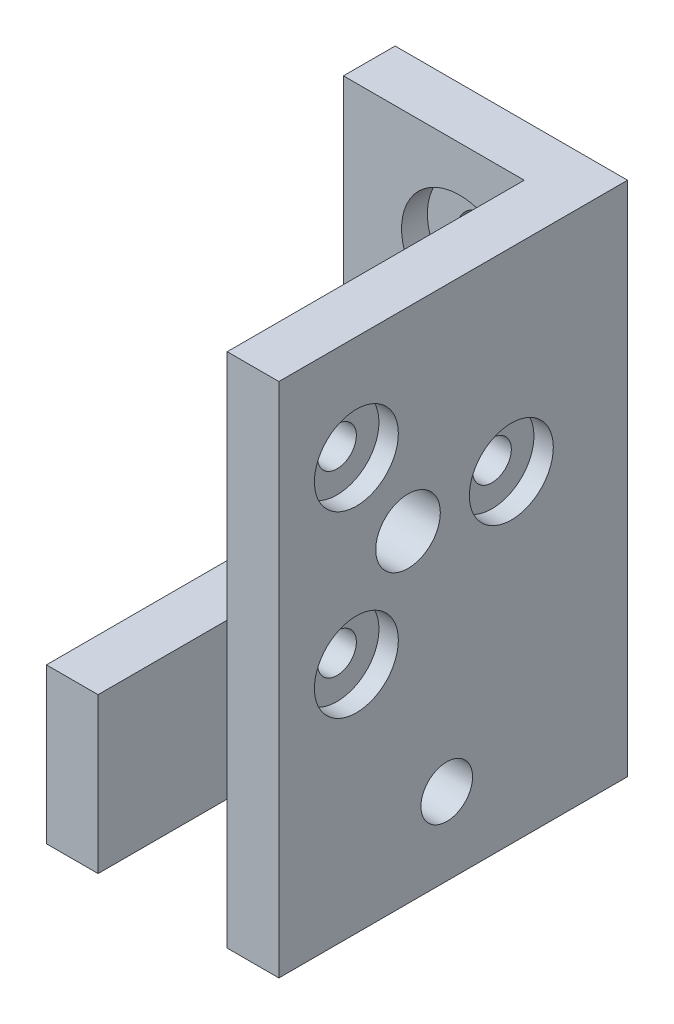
ISO-10303-21;
HEADER;
FILE_DESCRIPTION(('STEP AP214'),'2;1');
FILE_NAME('part.step','',(''),(''),'','','');
FILE_SCHEMA(('AUTOMOTIVE_DESIGN { 1 0 10303 214 1 1 1 1 }'));
ENDSEC;
DATA;
#1=APPLICATION_CONTEXT('core data for automotive mechanical design processes');
#2=APPLICATION_PROTOCOL_DEFINITION('international standard','automotive_design',2000,#1);
#3=PRODUCT_CONTEXT('',#1,'mechanical');
#4=PRODUCT('Part','Part','',(#3));
#5=PRODUCT_RELATED_PRODUCT_CATEGORY('part','',(#4));
#6=PRODUCT_DEFINITION_FORMATION('','',#4);
#7=PRODUCT_DEFINITION_CONTEXT('part definition',#1,'design');
#8=PRODUCT_DEFINITION('design','',#6,#7);
#9=PRODUCT_DEFINITION_SHAPE('','',#8);
#10=(LENGTH_UNIT() NAMED_UNIT(*) SI_UNIT(.MILLI.,.METRE.));
#11=(NAMED_UNIT(*) PLANE_ANGLE_UNIT() SI_UNIT($,.RADIAN.));
#12=(NAMED_UNIT(*) SI_UNIT($,.STERADIAN.) SOLID_ANGLE_UNIT());
#13=UNCERTAINTY_MEASURE_WITH_UNIT(LENGTH_MEASURE(1.E-05),#10,'distance_accuracy_value','');
#14=(GEOMETRIC_REPRESENTATION_CONTEXT(3) GLOBAL_UNCERTAINTY_ASSIGNED_CONTEXT((#13)) GLOBAL_UNIT_ASSIGNED_CONTEXT((#10,
#11,#12)) REPRESENTATION_CONTEXT('',''));
#15=CARTESIAN_POINT('',(0.,0.,0.));
#16=DIRECTION('',(0.,0.,1.));
#17=DIRECTION('',(1.,0.,0.));
#18=AXIS2_PLACEMENT_3D('',#15,#16,#17);
#19=CARTESIAN_POINT('',(9.,8.,-6.));
#20=DIRECTION('',(0.,0.,1.));
#21=DIRECTION('',(1.,0.,0.));
#22=AXIS2_PLACEMENT_3D('',#19,#20,#21);
#23=CYLINDRICAL_SURFACE('',#22,2.25);
#24=CARTESIAN_POINT('',(9.,8.,0.));
#25=DIRECTION('',(0.,0.,-1.));
#26=DIRECTION('',(-1.,0.,0.));
#27=AXIS2_PLACEMENT_3D('',#24,#25,#26);
#28=CIRCLE('',#27,2.25);
#29=CARTESIAN_POINT('',(6.75,8.,0.));
#30=VERTEX_POINT('',#29);
#31=EDGE_CURVE('E176',#30,#30,#28,.T.);
#32=ORIENTED_EDGE('',*,*,#31,.T.);
#33=EDGE_LOOP('',(#32));
#34=FACE_BOUND('',#33,.T.);
#35=CARTESIAN_POINT('',(9.,8.,2.));
#36=DIRECTION('',(0.,0.,1.));
#37=DIRECTION('',(1.,0.,0.));
#38=AXIS2_PLACEMENT_3D('',#35,#36,#37);
#39=CIRCLE('',#38,2.25);
#40=CARTESIAN_POINT('',(11.25,8.,2.));
#41=VERTEX_POINT('',#40);
#42=EDGE_CURVE('E37',#41,#41,#39,.F.);
#43=ORIENTED_EDGE('',*,*,#42,.F.);
#44=EDGE_LOOP('',(#43));
#45=FACE_BOUND('',#44,.T.);
#46=ADVANCED_FACE('F33',(#34,#45),#23,.F.);
#47=CARTESIAN_POINT('',(9.,32.,-6.));
#48=DIRECTION('',(0.,0.,1.));
#49=DIRECTION('',(1.,0.,0.));
#50=AXIS2_PLACEMENT_3D('',#47,#48,#49);
#51=CYLINDRICAL_SURFACE('',#50,2.25);
#52=CARTESIAN_POINT('',(9.,32.,0.));
#53=DIRECTION('',(0.,0.,-1.));
#54=DIRECTION('',(-1.,0.,0.));
#55=AXIS2_PLACEMENT_3D('',#52,#53,#54);
#56=CIRCLE('',#55,2.25);
#57=CARTESIAN_POINT('',(6.75,32.,0.));
#58=VERTEX_POINT('',#57);
#59=EDGE_CURVE('E172',#58,#58,#56,.T.);
#60=ORIENTED_EDGE('',*,*,#59,.T.);
#61=EDGE_LOOP('',(#60));
#62=FACE_BOUND('',#61,.T.);
#63=CARTESIAN_POINT('',(9.,32.,2.));
#64=DIRECTION('',(0.,0.,1.));
#65=DIRECTION('',(1.,0.,0.));
#66=AXIS2_PLACEMENT_3D('',#63,#64,#65);
#67=CIRCLE('',#66,2.25);
#68=CARTESIAN_POINT('',(11.25,32.,2.));
#69=VERTEX_POINT('',#68);
#70=EDGE_CURVE('E197',#69,#69,#67,.F.);
#71=ORIENTED_EDGE('',*,*,#70,.F.);
#72=EDGE_LOOP('',(#71));
#73=FACE_BOUND('',#72,.T.);
#74=ADVANCED_FACE('F308',(#62,#73),#51,.F.);
#75=CARTESIAN_POINT('',(24.,31.8923799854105,21.));
#76=DIRECTION('',(-1.,0.,0.));
#77=DIRECTION('',(0.,-1.,0.));
#78=AXIS2_PLACEMENT_3D('',#75,#76,#77);
#79=CYLINDRICAL_SURFACE('',#78,1.5);
#80=CARTESIAN_POINT('',(14.,31.8923799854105,21.));
#81=DIRECTION('',(-1.,0.,0.));
#82=DIRECTION('',(0.,-1.,0.));
#83=AXIS2_PLACEMENT_3D('',#80,#81,#82);
#84=CIRCLE('',#83,1.5);
#85=CARTESIAN_POINT('',(14.,30.3923799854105,21.));
#86=VERTEX_POINT('',#85);
#87=EDGE_CURVE('E231',#86,#86,#84,.T.);
#88=ORIENTED_EDGE('',*,*,#87,.T.);
#89=EDGE_LOOP('',(#88));
#90=FACE_BOUND('',#89,.T.);
#91=CARTESIAN_POINT('',(16.5,31.8923799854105,21.));
#92=DIRECTION('',(1.,0.,0.));
#93=DIRECTION('',(0.,0.,-1.));
#94=AXIS2_PLACEMENT_3D('',#91,#92,#93);
#95=CIRCLE('',#94,1.5);
#96=CARTESIAN_POINT('',(16.5,31.8923799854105,19.5));
#97=VERTEX_POINT('',#96);
#98=EDGE_CURVE('E193',#97,#97,#95,.F.);
#99=ORIENTED_EDGE('',*,*,#98,.F.);
#100=EDGE_LOOP('',(#99));
#101=FACE_BOUND('',#100,.T.);
#102=ADVANCED_FACE('F314',(#90,#101),#79,.F.);
#103=CARTESIAN_POINT('',(24.,18.0359735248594,21.));
#104=DIRECTION('',(-1.,0.,0.));
#105=DIRECTION('',(0.,-1.,0.));
#106=AXIS2_PLACEMENT_3D('',#103,#104,#105);
#107=CYLINDRICAL_SURFACE('',#106,1.5);
#108=CARTESIAN_POINT('',(14.,18.0359735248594,21.));
#109=DIRECTION('',(-1.,0.,0.));
#110=DIRECTION('',(0.,-1.,0.));
#111=AXIS2_PLACEMENT_3D('',#108,#109,#110);
#112=CIRCLE('',#111,1.5);
#113=CARTESIAN_POINT('',(14.,16.5359735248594,21.));
#114=VERTEX_POINT('',#113);
#115=EDGE_CURVE('E186',#114,#114,#112,.T.);
#116=ORIENTED_EDGE('',*,*,#115,.T.);
#117=EDGE_LOOP('',(#116));
#118=FACE_BOUND('',#117,.T.);
#119=CARTESIAN_POINT('',(16.5,18.0359735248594,21.));
#120=DIRECTION('',(1.,0.,0.));
#121=DIRECTION('',(0.,0.,-1.));
#122=AXIS2_PLACEMENT_3D('',#119,#120,#121);
#123=CIRCLE('',#122,1.5);
#124=CARTESIAN_POINT('',(16.5,18.0359735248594,19.5));
#125=VERTEX_POINT('',#124);
#126=EDGE_CURVE('E188',#125,#125,#123,.F.);
#127=ORIENTED_EDGE('',*,*,#126,.F.);
#128=EDGE_LOOP('',(#127));
#129=FACE_BOUND('',#128,.T.);
#130=ADVANCED_FACE('F339',(#118,#129),#107,.F.);
#131=CARTESIAN_POINT('',(24.,24.9641767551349,9.));
#132=DIRECTION('',(-1.,0.,0.));
#133=DIRECTION('',(0.,-1.,0.));
#134=AXIS2_PLACEMENT_3D('',#131,#132,#133);
#135=CYLINDRICAL_SURFACE('',#134,1.5);
#136=CARTESIAN_POINT('',(14.,24.9641767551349,9.));
#137=DIRECTION('',(-1.,0.,0.));
#138=DIRECTION('',(0.,-1.,0.));
#139=AXIS2_PLACEMENT_3D('',#136,#137,#138);
#140=CIRCLE('',#139,1.5);
#141=CARTESIAN_POINT('',(14.,23.4641767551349,9.));
#142=VERTEX_POINT('',#141);
#143=EDGE_CURVE('E228',#142,#142,#140,.T.);
#144=ORIENTED_EDGE('',*,*,#143,.T.);
#145=EDGE_LOOP('',(#144));
#146=FACE_BOUND('',#145,.T.);
#147=CARTESIAN_POINT('',(16.5,24.9641767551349,9.));
#148=DIRECTION('',(1.,0.,0.));
#149=DIRECTION('',(0.,0.,-1.));
#150=AXIS2_PLACEMENT_3D('',#147,#148,#149);
#151=CIRCLE('',#150,1.5);
#152=CARTESIAN_POINT('',(16.5,24.9641767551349,7.5));
#153=VERTEX_POINT('',#152);
#154=EDGE_CURVE('E183',#153,#153,#151,.F.);
#155=ORIENTED_EDGE('',*,*,#154,.F.);
#156=EDGE_LOOP('',(#155));
#157=FACE_BOUND('',#156,.T.);
#158=ADVANCED_FACE('F334',(#146,#157),#135,.F.);
#159=CARTESIAN_POINT('',(0.,40.,4.));
#160=DIRECTION('',(0.,0.,-1.));
#161=DIRECTION('',(-1.,0.,0.));
#162=AXIS2_PLACEMENT_3D('',#159,#160,#161);
#163=PLANE('',#162);
#164=CARTESIAN_POINT('',(9.,8.,4.));
#165=DIRECTION('',(0.,0.,1.));
#166=DIRECTION('',(1.,0.,0.));
#167=AXIS2_PLACEMENT_3D('',#164,#165,#166);
#168=CIRCLE('',#167,4.5);
#169=CARTESIAN_POINT('',(13.5,8.,4.));
#170=VERTEX_POINT('',#169);
#171=EDGE_CURVE('E213',#170,#170,#168,.T.);
#172=ORIENTED_EDGE('',*,*,#171,.F.);
#173=EDGE_LOOP('',(#172));
#174=FACE_BOUND('',#173,.T.);
#175=CARTESIAN_POINT('',(9.,32.,4.));
#176=DIRECTION('',(0.,0.,1.));
#177=DIRECTION('',(1.,0.,0.));
#178=AXIS2_PLACEMENT_3D('',#175,#176,#177);
#179=CIRCLE('',#178,4.5);
#180=CARTESIAN_POINT('',(13.5,32.,4.));
#181=VERTEX_POINT('',#180);
#182=EDGE_CURVE('E206',#181,#181,#179,.T.);
#183=ORIENTED_EDGE('',*,*,#182,.F.);
#184=EDGE_LOOP('',(#183));
#185=FACE_BOUND('',#184,.T.);
#186=DIRECTION('',(0.,-1.,0.));
#187=VECTOR('',#186,1.);
#188=CARTESIAN_POINT('',(14.,40.,4.));
#189=LINE('',#188,#187);
#190=CARTESIAN_POINT('',(14.,40.,4.));
#191=VERTEX_POINT('',#190);
#192=CARTESIAN_POINT('',(14.,0.,4.));
#193=VERTEX_POINT('',#192);
#194=EDGE_CURVE('E130',#191,#193,#189,.T.);
#195=ORIENTED_EDGE('',*,*,#194,.F.);
#196=DIRECTION('',(-1.,0.,0.));
#197=VECTOR('',#196,1.);
#198=CARTESIAN_POINT('',(0.,40.,4.));
#199=LINE('',#198,#197);
#200=CARTESIAN_POINT('',(0.,40.,4.));
#201=VERTEX_POINT('',#200);
#202=EDGE_CURVE('E262',#191,#201,#199,.T.);
#203=ORIENTED_EDGE('',*,*,#202,.T.);
#204=DIRECTION('',(0.,-1.,0.));
#205=VECTOR('',#204,1.);
#206=CARTESIAN_POINT('',(0.,0.,4.));
#207=LINE('',#206,#205);
#208=CARTESIAN_POINT('',(0.,12.,4.));
#209=VERTEX_POINT('',#208);
#210=EDGE_CURVE('E268',#201,#209,#207,.T.);
#211=ORIENTED_EDGE('',*,*,#210,.T.);
#212=DIRECTION('',(-1.,0.,0.));
#213=VECTOR('',#212,1.);
#214=CARTESIAN_POINT('',(0.,12.,4.));
#215=LINE('',#214,#213);
#216=CARTESIAN_POINT('',(4.,12.,4.));
#217=VERTEX_POINT('',#216);
#218=EDGE_CURVE('E147',#217,#209,#215,.T.);
#219=ORIENTED_EDGE('',*,*,#218,.F.);
#220=DIRECTION('',(0.,1.,0.));
#221=VECTOR('',#220,1.);
#222=CARTESIAN_POINT('',(4.,0.,4.));
#223=LINE('',#222,#221);
#224=CARTESIAN_POINT('',(4.,0.,4.));
#225=VERTEX_POINT('',#224);
#226=EDGE_CURVE('E55',#225,#217,#223,.T.);
#227=ORIENTED_EDGE('',*,*,#226,.F.);
#228=DIRECTION('',(1.,0.,0.));
#229=VECTOR('',#228,1.);
#230=CARTESIAN_POINT('',(0.,0.,4.));
#231=LINE('',#230,#229);
#232=EDGE_CURVE('E50',#225,#193,#231,.T.);
#233=ORIENTED_EDGE('',*,*,#232,.T.);
#234=EDGE_LOOP('',(#195,#203,#211,#219,#227,#233));
#235=FACE_BOUND('',#234,.T.);
#236=ADVANCED_FACE('F246',(#174,#185,#235),#163,.F.);
#237=CARTESIAN_POINT('',(0.,0.,4.));
#238=DIRECTION('',(1.,0.,0.));
#239=DIRECTION('',(0.,0.,-1.));
#240=AXIS2_PLACEMENT_3D('',#237,#238,#239);
#241=PLANE('',#240);
#242=CARTESIAN_POINT('',(0.,6.,14.));
#243=DIRECTION('',(-1.,0.,0.));
#244=DIRECTION('',(0.,0.,1.));
#245=AXIS2_PLACEMENT_3D('',#242,#243,#244);
#246=CIRCLE('',#245,2.);
#247=CARTESIAN_POINT('',(0.,6.,16.));
#248=VERTEX_POINT('',#247);
#249=EDGE_CURVE('E175',#248,#248,#246,.T.);
#250=ORIENTED_EDGE('',*,*,#249,.F.);
#251=EDGE_LOOP('',(#250));
#252=FACE_BOUND('',#251,.T.);
#253=DIRECTION('',(0.,-1.,0.));
#254=VECTOR('',#253,1.);
#255=CARTESIAN_POINT('',(0.,0.,0.));
#256=LINE('',#255,#254);
#257=CARTESIAN_POINT('',(0.,40.,0.));
#258=VERTEX_POINT('',#257);
#259=CARTESIAN_POINT('',(0.,0.,0.));
#260=VERTEX_POINT('',#259);
#261=EDGE_CURVE('E250',#258,#260,#256,.T.);
#262=ORIENTED_EDGE('',*,*,#261,.T.);
#263=DIRECTION('',(0.,0.,-1.));
#264=VECTOR('',#263,1.);
#265=CARTESIAN_POINT('',(0.,0.,4.));
#266=LINE('',#265,#264);
#267=CARTESIAN_POINT('',(0.,0.,27.));
#268=VERTEX_POINT('',#267);
#269=EDGE_CURVE('E11',#268,#260,#266,.T.);
#270=ORIENTED_EDGE('',*,*,#269,.F.);
#271=DIRECTION('',(0.,-1.,0.));
#272=VECTOR('',#271,1.);
#273=CARTESIAN_POINT('',(0.,0.,27.));
#274=LINE('',#273,#272);
#275=CARTESIAN_POINT('',(0.,12.,27.));
#276=VERTEX_POINT('',#275);
#277=EDGE_CURVE('E143',#276,#268,#274,.T.);
#278=ORIENTED_EDGE('',*,*,#277,.F.);
#279=DIRECTION('',(0.,0.,-1.));
#280=VECTOR('',#279,1.);
#281=CARTESIAN_POINT('',(0.,12.,27.));
#282=LINE('',#281,#280);
#283=EDGE_CURVE('E153',#276,#209,#282,.T.);
#284=ORIENTED_EDGE('',*,*,#283,.T.);
#285=ORIENTED_EDGE('',*,*,#210,.F.);
#286=DIRECTION('',(0.,0.,-1.));
#287=VECTOR('',#286,1.);
#288=CARTESIAN_POINT('',(0.,40.,4.));
#289=LINE('',#288,#287);
#290=EDGE_CURVE('E115',#201,#258,#289,.T.);
#291=ORIENTED_EDGE('',*,*,#290,.T.);
#292=EDGE_LOOP('',(#262,#270,#278,#284,#285,#291));
#293=FACE_BOUND('',#292,.T.);
#294=ADVANCED_FACE('F35',(#252,#293),#241,.F.);
#295=CARTESIAN_POINT('',(0.,0.,4.));
#296=DIRECTION('',(0.,1.,0.));
#297=DIRECTION('',(0.,0.,1.));
#298=AXIS2_PLACEMENT_3D('',#295,#296,#297);
#299=PLANE('',#298);
#300=DIRECTION('',(1.,0.,0.));
#301=VECTOR('',#300,1.);
#302=CARTESIAN_POINT('',(0.,0.,0.));
#303=LINE('',#302,#301);
#304=CARTESIAN_POINT('',(18.,0.,0.));
#305=VERTEX_POINT('',#304);
#306=EDGE_CURVE('E256',#260,#305,#303,.T.);
#307=ORIENTED_EDGE('',*,*,#306,.T.);
#308=DIRECTION('',(0.,0.,-1.));
#309=VECTOR('',#308,1.);
#310=CARTESIAN_POINT('',(18.,0.,4.));
#311=LINE('',#310,#309);
#312=CARTESIAN_POINT('',(18.,0.,27.));
#313=VERTEX_POINT('',#312);
#314=EDGE_CURVE('E42',#313,#305,#311,.T.);
#315=ORIENTED_EDGE('',*,*,#314,.F.);
#316=DIRECTION('',(1.,0.,0.));
#317=VECTOR('',#316,1.);
#318=CARTESIAN_POINT('',(18.,0.,27.));
#319=LINE('',#318,#317);
#320=CARTESIAN_POINT('',(14.,0.,27.));
#321=VERTEX_POINT('',#320);
#322=EDGE_CURVE('E129',#321,#313,#319,.T.);
#323=ORIENTED_EDGE('',*,*,#322,.F.);
#324=DIRECTION('',(0.,0.,-1.));
#325=VECTOR('',#324,1.);
#326=CARTESIAN_POINT('',(14.,0.,27.));
#327=LINE('',#326,#325);
#328=EDGE_CURVE('E138',#321,#193,#327,.T.);
#329=ORIENTED_EDGE('',*,*,#328,.T.);
#330=ORIENTED_EDGE('',*,*,#232,.F.);
#331=DIRECTION('',(0.,0.,-1.));
#332=VECTOR('',#331,1.);
#333=CARTESIAN_POINT('',(4.,0.,27.));
#334=LINE('',#333,#332);
#335=CARTESIAN_POINT('',(4.,0.,27.));
#336=VERTEX_POINT('',#335);
#337=EDGE_CURVE('E257',#336,#225,#334,.T.);
#338=ORIENTED_EDGE('',*,*,#337,.F.);
#339=DIRECTION('',(1.,0.,0.));
#340=VECTOR('',#339,1.);
#341=CARTESIAN_POINT('',(0.,0.,27.));
#342=LINE('',#341,#340);
#343=EDGE_CURVE('E146',#268,#336,#342,.T.);
#344=ORIENTED_EDGE('',*,*,#343,.F.);
#345=ORIENTED_EDGE('',*,*,#269,.T.);
#346=EDGE_LOOP('',(#307,#315,#323,#329,#330,#338,#344,#345));
#347=FACE_BOUND('',#346,.T.);
#348=ADVANCED_FACE('F245',(#347),#299,.F.);
#349=CARTESIAN_POINT('',(18.,0.,4.));
#350=DIRECTION('',(-1.,0.,0.));
#351=DIRECTION('',(0.,0.,1.));
#352=AXIS2_PLACEMENT_3D('',#349,#350,#351);
#353=PLANE('',#352);
#354=CARTESIAN_POINT('',(18.,31.8923799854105,21.));
#355=DIRECTION('',(1.,0.,0.));
#356=DIRECTION('',(0.,0.,-1.));
#357=AXIS2_PLACEMENT_3D('',#354,#355,#356);
#358=CIRCLE('',#357,3.25000000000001);
#359=CARTESIAN_POINT('',(18.,31.8923799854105,17.75));
#360=VERTEX_POINT('',#359);
#361=EDGE_CURVE('E199',#360,#360,#358,.T.);
#362=ORIENTED_EDGE('',*,*,#361,.F.);
#363=EDGE_LOOP('',(#362));
#364=FACE_BOUND('',#363,.T.);
#365=CARTESIAN_POINT('',(18.,18.0359735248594,21.));
#366=DIRECTION('',(1.,0.,0.));
#367=DIRECTION('',(0.,0.,-1.));
#368=AXIS2_PLACEMENT_3D('',#365,#366,#367);
#369=CIRCLE('',#368,3.25);
#370=CARTESIAN_POINT('',(18.,18.0359735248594,17.75));
#371=VERTEX_POINT('',#370);
#372=EDGE_CURVE('E195',#371,#371,#369,.T.);
#373=ORIENTED_EDGE('',*,*,#372,.F.);
#374=EDGE_LOOP('',(#373));
#375=FACE_BOUND('',#374,.T.);
#376=CARTESIAN_POINT('',(18.,24.9641767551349,9.));
#377=DIRECTION('',(1.,0.,0.));
#378=DIRECTION('',(0.,0.,-1.));
#379=AXIS2_PLACEMENT_3D('',#376,#377,#378);
#380=CIRCLE('',#379,3.25);
#381=CARTESIAN_POINT('',(18.,24.9641767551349,5.75));
#382=VERTEX_POINT('',#381);
#383=EDGE_CURVE('E191',#382,#382,#380,.T.);
#384=ORIENTED_EDGE('',*,*,#383,.F.);
#385=EDGE_LOOP('',(#384));
#386=FACE_BOUND('',#385,.T.);
#387=CARTESIAN_POINT('',(18.,24.9641767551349,17.));
#388=DIRECTION('',(1.,0.,0.));
#389=DIRECTION('',(0.,0.,-1.));
#390=AXIS2_PLACEMENT_3D('',#387,#388,#389);
#391=CIRCLE('',#390,2.5);
#392=CARTESIAN_POINT('',(18.,24.9641767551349,14.5));
#393=VERTEX_POINT('',#392);
#394=EDGE_CURVE('E182',#393,#393,#391,.T.);
#395=ORIENTED_EDGE('',*,*,#394,.F.);
#396=EDGE_LOOP('',(#395));
#397=FACE_BOUND('',#396,.T.);
#398=CARTESIAN_POINT('',(18.,6.,14.));
#399=DIRECTION('',(-1.,0.,0.));
#400=DIRECTION('',(0.,0.,1.));
#401=AXIS2_PLACEMENT_3D('',#398,#399,#400);
#402=CIRCLE('',#401,2.);
#403=CARTESIAN_POINT('',(18.,6.,16.));
#404=VERTEX_POINT('',#403);
#405=EDGE_CURVE('E171',#404,#404,#402,.T.);
#406=ORIENTED_EDGE('',*,*,#405,.T.);
#407=EDGE_LOOP('',(#406));
#408=FACE_BOUND('',#407,.T.);
#409=DIRECTION('',(0.,1.,0.));
#410=VECTOR('',#409,1.);
#411=CARTESIAN_POINT('',(18.,0.,0.));
#412=LINE('',#411,#410);
#413=CARTESIAN_POINT('',(18.,40.,0.));
#414=VERTEX_POINT('',#413);
#415=EDGE_CURVE('E112',#305,#414,#412,.T.);
#416=ORIENTED_EDGE('',*,*,#415,.T.);
#417=DIRECTION('',(0.,0.,-1.));
#418=VECTOR('',#417,1.);
#419=CARTESIAN_POINT('',(18.,40.,4.));
#420=LINE('',#419,#418);
#421=CARTESIAN_POINT('',(18.,40.,27.));
#422=VERTEX_POINT('',#421);
#423=EDGE_CURVE('E105',#422,#414,#420,.T.);
#424=ORIENTED_EDGE('',*,*,#423,.F.);
#425=DIRECTION('',(0.,1.,0.));
#426=VECTOR('',#425,1.);
#427=CARTESIAN_POINT('',(18.,40.,27.));
#428=LINE('',#427,#426);
#429=EDGE_CURVE('E110',#313,#422,#428,.T.);
#430=ORIENTED_EDGE('',*,*,#429,.F.);
#431=ORIENTED_EDGE('',*,*,#314,.T.);
#432=EDGE_LOOP('',(#416,#424,#430,#431));
#433=FACE_BOUND('',#432,.T.);
#434=ADVANCED_FACE('F107',(#364,#375,#386,#397,#408,#433),#353,.F.);
#435=CARTESIAN_POINT('',(0.,40.,4.));
#436=DIRECTION('',(0.,-1.,0.));
#437=DIRECTION('',(0.,0.,-1.));
#438=AXIS2_PLACEMENT_3D('',#435,#436,#437);
#439=PLANE('',#438);
#440=DIRECTION('',(-1.,0.,0.));
#441=VECTOR('',#440,1.);
#442=CARTESIAN_POINT('',(0.,40.,0.));
#443=LINE('',#442,#441);
#444=EDGE_CURVE('E266',#414,#258,#443,.T.);
#445=ORIENTED_EDGE('',*,*,#444,.T.);
#446=ORIENTED_EDGE('',*,*,#290,.F.);
#447=ORIENTED_EDGE('',*,*,#202,.F.);
#448=DIRECTION('',(0.,0.,-1.));
#449=VECTOR('',#448,1.);
#450=CARTESIAN_POINT('',(14.,40.,27.));
#451=LINE('',#450,#449);
#452=CARTESIAN_POINT('',(14.,40.,27.));
#453=VERTEX_POINT('',#452);
#454=EDGE_CURVE('E121',#453,#191,#451,.T.);
#455=ORIENTED_EDGE('',*,*,#454,.F.);
#456=DIRECTION('',(-1.,0.,0.));
#457=VECTOR('',#456,1.);
#458=CARTESIAN_POINT('',(18.,40.,27.));
#459=LINE('',#458,#457);
#460=EDGE_CURVE('E118',#422,#453,#459,.T.);
#461=ORIENTED_EDGE('',*,*,#460,.F.);
#462=ORIENTED_EDGE('',*,*,#423,.T.);
#463=EDGE_LOOP('',(#445,#446,#447,#455,#461,#462));
#464=FACE_BOUND('',#463,.T.);
#465=ADVANCED_FACE('F119',(#464),#439,.F.);
#466=CARTESIAN_POINT('',(0.,40.,0.));
#467=DIRECTION('',(0.,0.,-1.));
#468=DIRECTION('',(-1.,0.,0.));
#469=AXIS2_PLACEMENT_3D('',#466,#467,#468);
#470=PLANE('',#469);
#471=ORIENTED_EDGE('',*,*,#31,.F.);
#472=EDGE_LOOP('',(#471));
#473=FACE_BOUND('',#472,.T.);
#474=ORIENTED_EDGE('',*,*,#59,.F.);
#475=EDGE_LOOP('',(#474));
#476=FACE_BOUND('',#475,.T.);
#477=ORIENTED_EDGE('',*,*,#261,.F.);
#478=ORIENTED_EDGE('',*,*,#444,.F.);
#479=ORIENTED_EDGE('',*,*,#415,.F.);
#480=ORIENTED_EDGE('',*,*,#306,.F.);
#481=EDGE_LOOP('',(#477,#478,#479,#480));
#482=FACE_BOUND('',#481,.T.);
#483=ADVANCED_FACE('F293',(#473,#476,#482),#470,.T.);
#484=CARTESIAN_POINT('',(4.,0.,27.));
#485=DIRECTION('',(-1.,0.,0.));
#486=DIRECTION('',(0.,0.,1.));
#487=AXIS2_PLACEMENT_3D('',#484,#485,#486);
#488=PLANE('',#487);
#489=CARTESIAN_POINT('',(4.,6.,14.));
#490=DIRECTION('',(-1.,0.,0.));
#491=DIRECTION('',(0.,0.,1.));
#492=AXIS2_PLACEMENT_3D('',#489,#490,#491);
#493=CIRCLE('',#492,2.);
#494=CARTESIAN_POINT('',(4.,6.,16.));
#495=VERTEX_POINT('',#494);
#496=EDGE_CURVE('E132',#495,#495,#493,.T.);
#497=ORIENTED_EDGE('',*,*,#496,.T.);
#498=EDGE_LOOP('',(#497));
#499=FACE_BOUND('',#498,.T.);
#500=ORIENTED_EDGE('',*,*,#226,.T.);
#501=DIRECTION('',(0.,0.,-1.));
#502=VECTOR('',#501,1.);
#503=CARTESIAN_POINT('',(4.,12.,27.));
#504=LINE('',#503,#502);
#505=CARTESIAN_POINT('',(4.,12.,27.));
#506=VERTEX_POINT('',#505);
#507=EDGE_CURVE('E156',#506,#217,#504,.T.);
#508=ORIENTED_EDGE('',*,*,#507,.F.);
#509=DIRECTION('',(0.,1.,0.));
#510=VECTOR('',#509,1.);
#511=CARTESIAN_POINT('',(4.,0.,27.));
#512=LINE('',#511,#510);
#513=EDGE_CURVE('E149',#336,#506,#512,.T.);
#514=ORIENTED_EDGE('',*,*,#513,.F.);
#515=ORIENTED_EDGE('',*,*,#337,.T.);
#516=EDGE_LOOP('',(#500,#508,#514,#515));
#517=FACE_BOUND('',#516,.T.);
#518=ADVANCED_FACE('F280',(#499,#517),#488,.F.);
#519=CARTESIAN_POINT('',(0.,12.,27.));
#520=DIRECTION('',(0.,-1.,0.));
#521=DIRECTION('',(0.,0.,-1.));
#522=AXIS2_PLACEMENT_3D('',#519,#520,#521);
#523=PLANE('',#522);
#524=ORIENTED_EDGE('',*,*,#218,.T.);
#525=ORIENTED_EDGE('',*,*,#283,.F.);
#526=DIRECTION('',(-1.,0.,0.));
#527=VECTOR('',#526,1.);
#528=CARTESIAN_POINT('',(0.,12.,27.));
#529=LINE('',#528,#527);
#530=EDGE_CURVE('E151',#506,#276,#529,.T.);
#531=ORIENTED_EDGE('',*,*,#530,.F.);
#532=ORIENTED_EDGE('',*,*,#507,.T.);
#533=EDGE_LOOP('',(#524,#525,#531,#532));
#534=FACE_BOUND('',#533,.T.);
#535=ADVANCED_FACE('F285',(#534),#523,.F.);
#536=CARTESIAN_POINT('',(0.,12.,27.));
#537=DIRECTION('',(0.,0.,-1.));
#538=DIRECTION('',(-1.,0.,0.));
#539=AXIS2_PLACEMENT_3D('',#536,#537,#538);
#540=PLANE('',#539);
#541=ORIENTED_EDGE('',*,*,#277,.T.);
#542=ORIENTED_EDGE('',*,*,#343,.T.);
#543=ORIENTED_EDGE('',*,*,#513,.T.);
#544=ORIENTED_EDGE('',*,*,#530,.T.);
#545=EDGE_LOOP('',(#541,#542,#543,#544));
#546=FACE_BOUND('',#545,.T.);
#547=ADVANCED_FACE('F288',(#546),#540,.F.);
#548=CARTESIAN_POINT('',(14.,40.,27.));
#549=DIRECTION('',(1.,0.,0.));
#550=DIRECTION('',(0.,1.,0.));
#551=AXIS2_PLACEMENT_3D('',#548,#549,#550);
#552=PLANE('',#551);
#553=ORIENTED_EDGE('',*,*,#115,.F.);
#554=EDGE_LOOP('',(#553));
#555=FACE_BOUND('',#554,.T.);
#556=ORIENTED_EDGE('',*,*,#143,.F.);
#557=EDGE_LOOP('',(#556));
#558=FACE_BOUND('',#557,.T.);
#559=ORIENTED_EDGE('',*,*,#87,.F.);
#560=EDGE_LOOP('',(#559));
#561=FACE_BOUND('',#560,.T.);
#562=CARTESIAN_POINT('',(14.,24.9641767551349,17.));
#563=DIRECTION('',(1.,0.,0.));
#564=DIRECTION('',(0.,1.,0.));
#565=AXIS2_PLACEMENT_3D('',#562,#563,#564);
#566=CIRCLE('',#565,2.5);
#567=CARTESIAN_POINT('',(14.,27.4641767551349,17.));
#568=VERTEX_POINT('',#567);
#569=EDGE_CURVE('E179',#568,#568,#566,.T.);
#570=ORIENTED_EDGE('',*,*,#569,.T.);
#571=EDGE_LOOP('',(#570));
#572=FACE_BOUND('',#571,.T.);
#573=CARTESIAN_POINT('',(14.,6.,14.));
#574=DIRECTION('',(1.,0.,0.));
#575=DIRECTION('',(0.,1.,0.));
#576=AXIS2_PLACEMENT_3D('',#573,#574,#575);
#577=CIRCLE('',#576,2.);
#578=CARTESIAN_POINT('',(14.,8.,14.));
#579=VERTEX_POINT('',#578);
#580=EDGE_CURVE('E168',#579,#579,#577,.T.);
#581=ORIENTED_EDGE('',*,*,#580,.T.);
#582=EDGE_LOOP('',(#581));
#583=FACE_BOUND('',#582,.T.);
#584=ORIENTED_EDGE('',*,*,#194,.T.);
#585=ORIENTED_EDGE('',*,*,#328,.F.);
#586=DIRECTION('',(0.,-1.,0.));
#587=VECTOR('',#586,1.);
#588=CARTESIAN_POINT('',(14.,40.,27.));
#589=LINE('',#588,#587);
#590=EDGE_CURVE('E124',#453,#321,#589,.T.);
#591=ORIENTED_EDGE('',*,*,#590,.F.);
#592=ORIENTED_EDGE('',*,*,#454,.T.);
#593=EDGE_LOOP('',(#584,#585,#591,#592));
#594=FACE_BOUND('',#593,.T.);
#595=ADVANCED_FACE('F292',(#555,#558,#561,#572,#583,#594),#552,.F.);
#596=CARTESIAN_POINT('',(18.,0.,27.));
#597=DIRECTION('',(0.,0.,-1.));
#598=DIRECTION('',(-1.,0.,0.));
#599=AXIS2_PLACEMENT_3D('',#596,#597,#598);
#600=PLANE('',#599);
#601=ORIENTED_EDGE('',*,*,#429,.T.);
#602=ORIENTED_EDGE('',*,*,#460,.T.);
#603=ORIENTED_EDGE('',*,*,#590,.T.);
#604=ORIENTED_EDGE('',*,*,#322,.T.);
#605=EDGE_LOOP('',(#601,#602,#603,#604));
#606=FACE_BOUND('',#605,.T.);
#607=ADVANCED_FACE('F127',(#606),#600,.F.);
#608=CARTESIAN_POINT('',(18.,6.,14.));
#609=DIRECTION('',(-1.,0.,0.));
#610=DIRECTION('',(0.,0.,1.));
#611=AXIS2_PLACEMENT_3D('',#608,#609,#610);
#612=CYLINDRICAL_SURFACE('',#611,2.);
#613=ORIENTED_EDGE('',*,*,#405,.F.);
#614=EDGE_LOOP('',(#613));
#615=FACE_BOUND('',#614,.T.);
#616=ORIENTED_EDGE('',*,*,#580,.F.);
#617=EDGE_LOOP('',(#616));
#618=FACE_BOUND('',#617,.T.);
#619=ADVANCED_FACE('F324',(#615,#618),#612,.F.);
#620=ORIENTED_EDGE('',*,*,#249,.T.);
#621=EDGE_LOOP('',(#620));
#622=FACE_BOUND('',#621,.T.);
#623=ORIENTED_EDGE('',*,*,#496,.F.);
#624=EDGE_LOOP('',(#623));
#625=FACE_BOUND('',#624,.T.);
#626=ADVANCED_FACE('F240',(#622,#625),#612,.F.);
#627=CARTESIAN_POINT('',(8.,24.9641767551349,17.));
#628=DIRECTION('',(1.,0.,0.));
#629=DIRECTION('',(0.,0.,-1.));
#630=AXIS2_PLACEMENT_3D('',#627,#628,#629);
#631=CYLINDRICAL_SURFACE('',#630,2.5);
#632=ORIENTED_EDGE('',*,*,#394,.T.);
#633=EDGE_LOOP('',(#632));
#634=FACE_BOUND('',#633,.T.);
#635=ORIENTED_EDGE('',*,*,#569,.F.);
#636=EDGE_LOOP('',(#635));
#637=FACE_BOUND('',#636,.T.);
#638=ADVANCED_FACE('F319',(#634,#637),#631,.F.);
#639=CARTESIAN_POINT('',(16.5,24.9641767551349,9.));
#640=DIRECTION('',(1.,0.,0.));
#641=DIRECTION('',(0.,0.,-1.));
#642=AXIS2_PLACEMENT_3D('',#639,#640,#641);
#643=PLANE('',#642);
#644=CARTESIAN_POINT('',(16.5,24.9641767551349,9.));
#645=DIRECTION('',(1.,0.,0.));
#646=DIRECTION('',(0.,0.,-1.));
#647=AXIS2_PLACEMENT_3D('',#644,#645,#646);
#648=CIRCLE('',#647,3.25);
#649=CARTESIAN_POINT('',(16.5,24.9641767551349,5.75));
#650=VERTEX_POINT('',#649);
#651=EDGE_CURVE('E187',#650,#650,#648,.T.);
#652=ORIENTED_EDGE('',*,*,#651,.T.);
#653=EDGE_LOOP('',(#652));
#654=FACE_BOUND('',#653,.T.);
#655=ORIENTED_EDGE('',*,*,#154,.T.);
#656=EDGE_LOOP('',(#655));
#657=FACE_BOUND('',#656,.T.);
#658=ADVANCED_FACE('F380',(#654,#657),#643,.T.);
#659=CARTESIAN_POINT('',(16.5,24.9641767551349,9.));
#660=DIRECTION('',(1.,0.,0.));
#661=DIRECTION('',(0.,0.,-1.));
#662=AXIS2_PLACEMENT_3D('',#659,#660,#661);
#663=CYLINDRICAL_SURFACE('',#662,3.25);
#664=ORIENTED_EDGE('',*,*,#651,.F.);
#665=EDGE_LOOP('',(#664));
#666=FACE_BOUND('',#665,.T.);
#667=ORIENTED_EDGE('',*,*,#383,.T.);
#668=EDGE_LOOP('',(#667));
#669=FACE_BOUND('',#668,.T.);
#670=ADVANCED_FACE('F375',(#666,#669),#663,.F.);
#671=CARTESIAN_POINT('',(16.5,18.0359735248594,21.));
#672=DIRECTION('',(1.,0.,0.));
#673=DIRECTION('',(0.,0.,-1.));
#674=AXIS2_PLACEMENT_3D('',#671,#672,#673);
#675=PLANE('',#674);
#676=CARTESIAN_POINT('',(16.5,18.0359735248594,21.));
#677=DIRECTION('',(1.,0.,0.));
#678=DIRECTION('',(0.,0.,-1.));
#679=AXIS2_PLACEMENT_3D('',#676,#677,#678);
#680=CIRCLE('',#679,3.25);
#681=CARTESIAN_POINT('',(16.5,18.0359735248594,17.75));
#682=VERTEX_POINT('',#681);
#683=EDGE_CURVE('E192',#682,#682,#680,.T.);
#684=ORIENTED_EDGE('',*,*,#683,.T.);
#685=EDGE_LOOP('',(#684));
#686=FACE_BOUND('',#685,.T.);
#687=ORIENTED_EDGE('',*,*,#126,.T.);
#688=EDGE_LOOP('',(#687));
#689=FACE_BOUND('',#688,.T.);
#690=ADVANCED_FACE('F372',(#686,#689),#675,.T.);
#691=CARTESIAN_POINT('',(16.5,18.0359735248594,21.));
#692=DIRECTION('',(1.,0.,0.));
#693=DIRECTION('',(0.,0.,-1.));
#694=AXIS2_PLACEMENT_3D('',#691,#692,#693);
#695=CYLINDRICAL_SURFACE('',#694,3.25);
#696=ORIENTED_EDGE('',*,*,#683,.F.);
#697=EDGE_LOOP('',(#696));
#698=FACE_BOUND('',#697,.T.);
#699=ORIENTED_EDGE('',*,*,#372,.T.);
#700=EDGE_LOOP('',(#699));
#701=FACE_BOUND('',#700,.T.);
#702=ADVANCED_FACE('F367',(#698,#701),#695,.F.);
#703=CARTESIAN_POINT('',(16.5,31.8923799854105,21.));
#704=DIRECTION('',(1.,0.,0.));
#705=DIRECTION('',(0.,0.,-1.));
#706=AXIS2_PLACEMENT_3D('',#703,#704,#705);
#707=PLANE('',#706);
#708=CARTESIAN_POINT('',(16.5,31.8923799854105,21.));
#709=DIRECTION('',(1.,0.,0.));
#710=DIRECTION('',(0.,0.,-1.));
#711=AXIS2_PLACEMENT_3D('',#708,#709,#710);
#712=CIRCLE('',#711,3.25000000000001);
#713=CARTESIAN_POINT('',(16.5,31.8923799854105,17.75));
#714=VERTEX_POINT('',#713);
#715=EDGE_CURVE('E196',#714,#714,#712,.T.);
#716=ORIENTED_EDGE('',*,*,#715,.T.);
#717=EDGE_LOOP('',(#716));
#718=FACE_BOUND('',#717,.T.);
#719=ORIENTED_EDGE('',*,*,#98,.T.);
#720=EDGE_LOOP('',(#719));
#721=FACE_BOUND('',#720,.T.);
#722=ADVANCED_FACE('F364',(#718,#721),#707,.T.);
#723=CARTESIAN_POINT('',(16.5,31.8923799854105,21.));
#724=DIRECTION('',(1.,0.,0.));
#725=DIRECTION('',(0.,0.,-1.));
#726=AXIS2_PLACEMENT_3D('',#723,#724,#725);
#727=CYLINDRICAL_SURFACE('',#726,3.25000000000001);
#728=ORIENTED_EDGE('',*,*,#715,.F.);
#729=EDGE_LOOP('',(#728));
#730=FACE_BOUND('',#729,.T.);
#731=ORIENTED_EDGE('',*,*,#361,.T.);
#732=EDGE_LOOP('',(#731));
#733=FACE_BOUND('',#732,.T.);
#734=ADVANCED_FACE('F360',(#730,#733),#727,.F.);
#735=CARTESIAN_POINT('',(9.,32.,2.));
#736=DIRECTION('',(0.,0.,1.));
#737=DIRECTION('',(1.,0.,0.));
#738=AXIS2_PLACEMENT_3D('',#735,#736,#737);
#739=PLANE('',#738);
#740=CARTESIAN_POINT('',(9.,32.,2.));
#741=DIRECTION('',(0.,0.,1.));
#742=DIRECTION('',(1.,0.,0.));
#743=AXIS2_PLACEMENT_3D('',#740,#741,#742);
#744=CIRCLE('',#743,4.5);
#745=CARTESIAN_POINT('',(13.5,32.,2.));
#746=VERTEX_POINT('',#745);
#747=EDGE_CURVE('E200',#746,#746,#744,.T.);
#748=ORIENTED_EDGE('',*,*,#747,.T.);
#749=EDGE_LOOP('',(#748));
#750=FACE_BOUND('',#749,.T.);
#751=ORIENTED_EDGE('',*,*,#70,.T.);
#752=EDGE_LOOP('',(#751));
#753=FACE_BOUND('',#752,.T.);
#754=ADVANCED_FACE('F350',(#750,#753),#739,.T.);
#755=CARTESIAN_POINT('',(9.,32.,2.));
#756=DIRECTION('',(0.,0.,1.));
#757=DIRECTION('',(1.,0.,0.));
#758=AXIS2_PLACEMENT_3D('',#755,#756,#757);
#759=CYLINDRICAL_SURFACE('',#758,4.5);
#760=ORIENTED_EDGE('',*,*,#747,.F.);
#761=EDGE_LOOP('',(#760));
#762=FACE_BOUND('',#761,.T.);
#763=ORIENTED_EDGE('',*,*,#182,.T.);
#764=EDGE_LOOP('',(#763));
#765=FACE_BOUND('',#764,.T.);
#766=ADVANCED_FACE('F347',(#762,#765),#759,.F.);
#767=CARTESIAN_POINT('',(9.,8.,2.));
#768=DIRECTION('',(0.,0.,1.));
#769=DIRECTION('',(1.,0.,0.));
#770=AXIS2_PLACEMENT_3D('',#767,#768,#769);
#771=PLANE('',#770);
#772=CARTESIAN_POINT('',(9.,8.,2.));
#773=DIRECTION('',(0.,0.,1.));
#774=DIRECTION('',(1.,0.,0.));
#775=AXIS2_PLACEMENT_3D('',#772,#773,#774);
#776=CIRCLE('',#775,4.5);
#777=CARTESIAN_POINT('',(13.5,8.,2.));
#778=VERTEX_POINT('',#777);
#779=EDGE_CURVE('E487',#778,#778,#776,.T.);
#780=ORIENTED_EDGE('',*,*,#779,.T.);
#781=EDGE_LOOP('',(#780));
#782=FACE_BOUND('',#781,.T.);
#783=ORIENTED_EDGE('',*,*,#42,.T.);
#784=EDGE_LOOP('',(#783));
#785=FACE_BOUND('',#784,.T.);
#786=ADVANCED_FACE('F349',(#782,#785),#771,.T.);
#787=CARTESIAN_POINT('',(9.,8.,2.));
#788=DIRECTION('',(0.,0.,1.));
#789=DIRECTION('',(1.,0.,0.));
#790=AXIS2_PLACEMENT_3D('',#787,#788,#789);
#791=CYLINDRICAL_SURFACE('',#790,4.5);
#792=ORIENTED_EDGE('',*,*,#779,.F.);
#793=EDGE_LOOP('',(#792));
#794=FACE_BOUND('',#793,.T.);
#795=ORIENTED_EDGE('',*,*,#171,.T.);
#796=EDGE_LOOP('',(#795));
#797=FACE_BOUND('',#796,.T.);
#798=ADVANCED_FACE('F357',(#794,#797),#791,.F.);
#799=CLOSED_SHELL('',(#46,#74,#102,#130,#158,#236,#294,#348,#434,#465,#483,#518,#535,#547,#595,
#607,#619,#626,#638,#658,#670,#690,#702,#722,#734,#754,#766,#786,#798));
#800=MANIFOLD_SOLID_BREP('B2',#799);
#801=ADVANCED_BREP_SHAPE_REPRESENTATION('',(#18,#800),#14);
#802=SHAPE_DEFINITION_REPRESENTATION(#9,#801);
ENDSEC;
END-ISO-10303-21;
